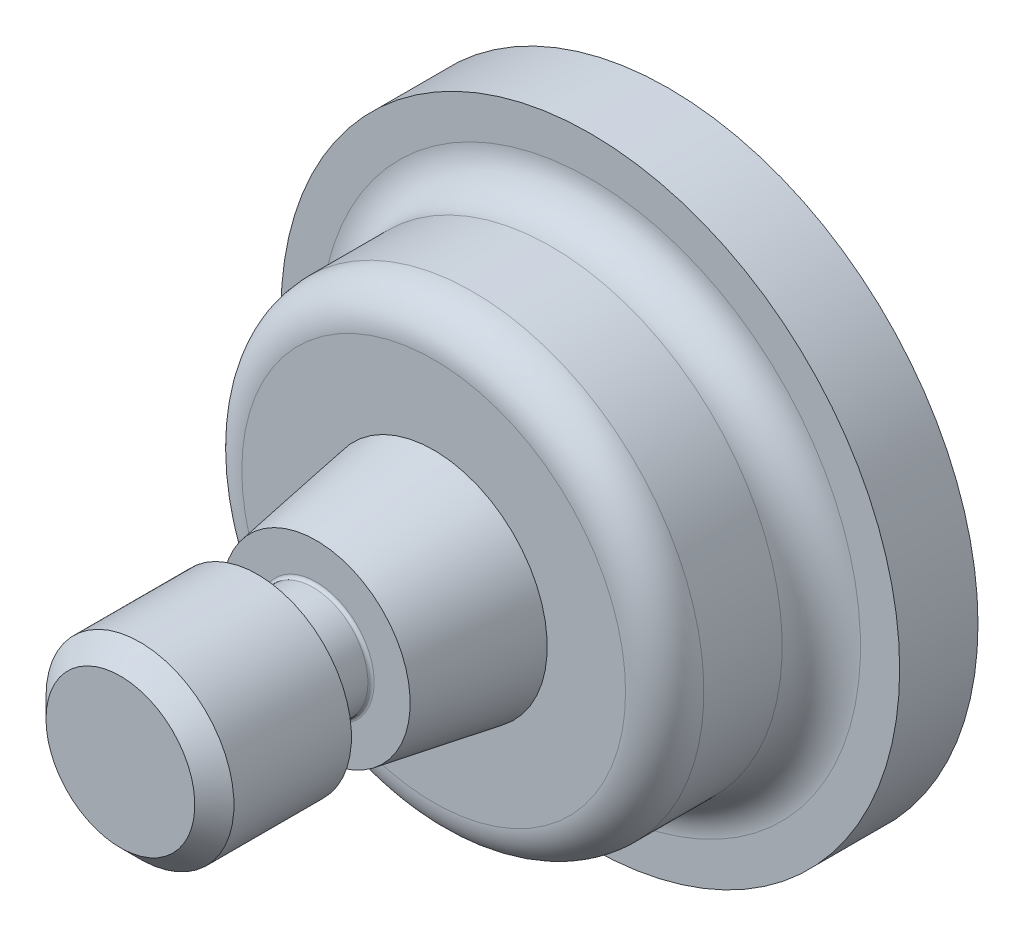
from build123d import *


with BuildPart() as part:
    # Sketch1 → Base-Revolve (revolve)
    with BuildSketch(Plane.ZY, mode=Mode.PRIVATE) as base_revolve_sk:
        with BuildLine():
            Line((-88.899984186, 50.165), (-76.198738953, 50.165))
            Line((-76.198738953, 50.165), (-76.198738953, 43.815))
            ThreePointArc((-76.198738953, 43.815), (-74.339229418, 39.325746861), (-69.849976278, 37.466237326))
            Line((-69.849976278, 37.466237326), (-57.15, 37.466237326))
            ThreePointArc((-57.15, 37.466237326), (-52.658991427, 35.606000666), (-50.798754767, 31.114992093))
            Line((-50.798754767, 31.114992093), (-50.798754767, 18.414784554))
            Line((-50.798754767, 18.414784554), (-31.75, 15.239992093))
            Line((-31.75, 15.239992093), (-31.75, 9.397992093))
            ThreePointArc((-31.75, 9.397992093), (-31.601210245, 9.038781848), (-31.242, 8.889992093))
            Line((-31.242, 8.889992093), (-22.733, 8.889992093))
            ThreePointArc((-22.733, 8.889992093), (-22.373789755, 9.038781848), (-22.225, 9.397992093))
            Line((-22.225, 9.397992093), (-22.225, 15.239992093))
            Line((-22.225, 15.239992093), (-3.175, 15.239992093))
            Line((-3.175, 15.239992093), (0, 12.064992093))
            Line((0, 12.064992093), (0, 0))
            Line((0, 0), (-88.899984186, 0))
            Line((-88.899984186, 0), (-88.899984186, 50.165))
        make_face()
    revolve(base_revolve_sk.sketch.rotate(Axis((0, 0, 0), (0, 0, 1)), 90), axis=Axis((0, 0, 0), (0, 0, 1)))


solid = part.part
